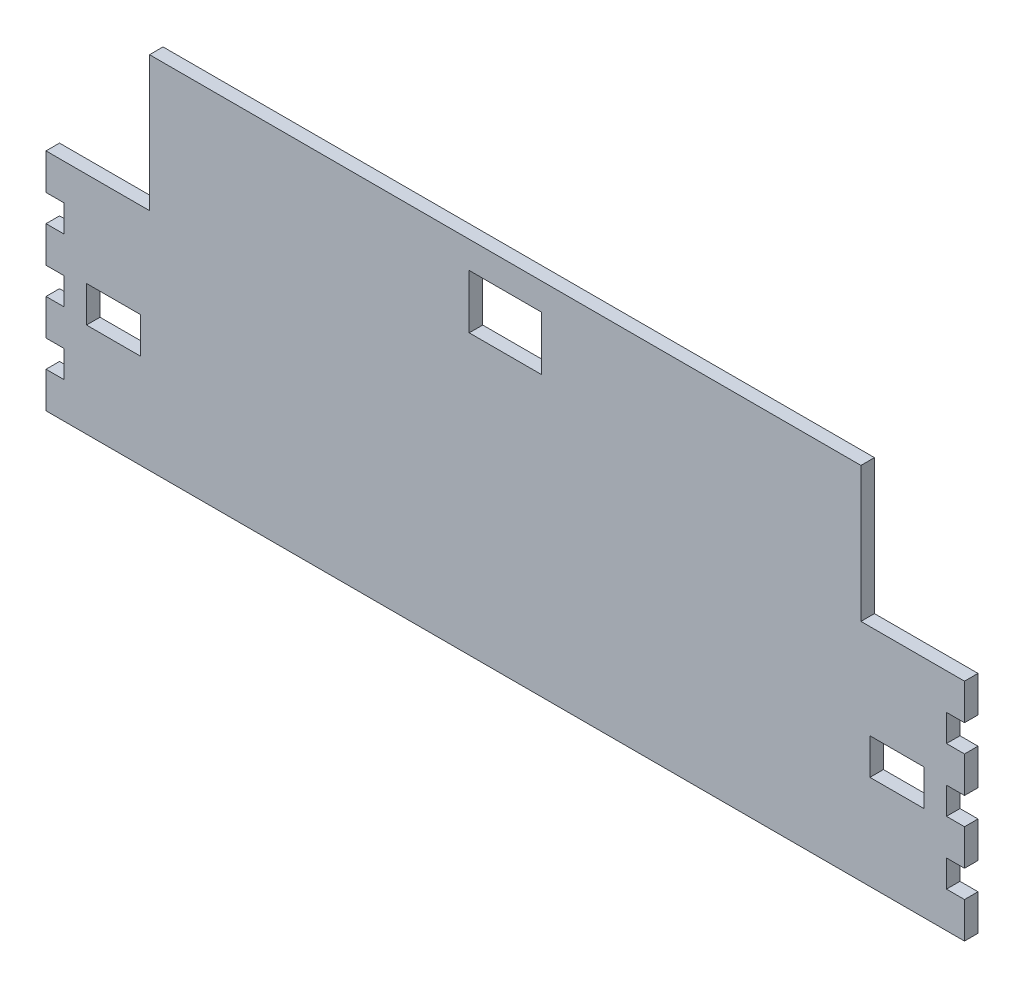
from build123d import *

# Parameters (mm, degrees)
ESQUISSE1_W      = 80
ESQUISSE1_H      = 60
ESQUISSE1_W_2    = 60
ESQUISSE1_H_2    = 40
EXTRUSION1_DEPTH = 15


with BuildPart() as part:
    # Esquisse1 → Extrusion1 (new body)
    with BuildSketch(Plane.XY):
        Polygon((-510, 0), (510, 0), (510, 40), (490, 40), (490, 70), (510, 70), (510, 110), (490, 110), (490, 140), (510, 140), (510, 180), (490, 180), (490, 210), (510, 210), (510, 250), (395, 250), (395, 400), (-395, 400), (-395, 250), (-510, 250), (-510, 210), (-490, 210), (-490, 180), (-510, 180), (-510, 140), (-490, 140), (-490, 110), (-510, 110), (-510, 70), (-490, 70), (-490, 40), (-510, 40), align=None)
        with Locations((0, 340)):
            Rectangle(ESQUISSE1_W, ESQUISSE1_H, mode=Mode.SUBTRACT)
        with Locations((435, 125)):
            Rectangle(ESQUISSE1_W_2, ESQUISSE1_H_2, mode=Mode.SUBTRACT)
        with Locations((-435, 125)):
            Rectangle(ESQUISSE1_W_2, ESQUISSE1_H_2, mode=Mode.SUBTRACT)
    extrude(amount=EXTRUSION1_DEPTH)


solid = part.part
